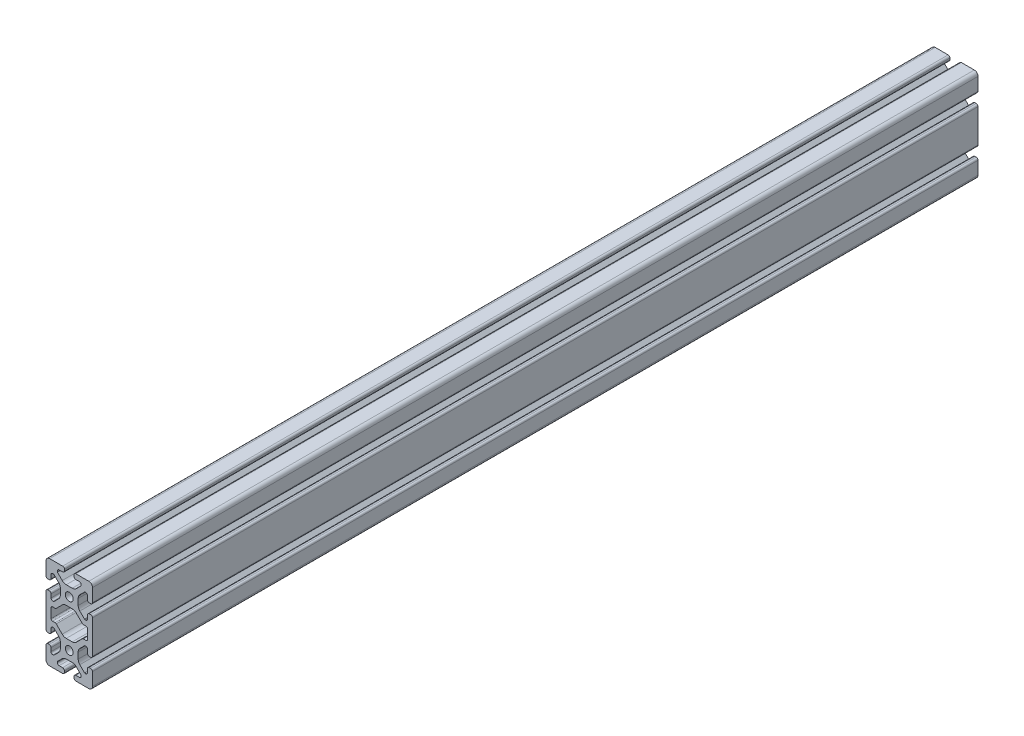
from build123d import *

# Parameters (mm, degrees)
SKETCH1_R           = 3.405
BOSS_EXTRUDE1_DEPTH = 3048
SKETCH26_W          = 40
SKETCH26_H          = 80.80011746
CUT_EXTRUDE1_DEPTH  = 2287.874723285
SKETCH33_W          = 40
SKETCH33_H          = 80.80011746
CUT_EXTRUDE2_DEPTH  = 1526.311771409


with BuildPart() as part:
    # Sketch1 → Boss-Extrude1 (new body)
    with BuildSketch(Plane(origin=(0, 0, -3048), x_dir=(-1, 0, 0), z_dir=(0, 0, -1))):
        with BuildLine():
            Line((16.83, 60), (5.69044933, 60))
            ThreePointArc((5.69044933, 60), (4.580291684, 59.540157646), (4.12044933, 58.43))
            Line((4.12044933, 58.43), (4.12044933, 57.25))
            ThreePointArc((4.12044933, 57.25), (4.580291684, 56.139842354), (5.69044933, 55.68))
            Line((5.69044933, 55.68), (8.7153995, 55.68))
            ThreePointArc((8.7153995, 55.68), (9.825557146, 55.220157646), (10.2853995, 54.11))
            Line((10.2853995, 54.11), (10.2853995, 53.654903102))
            ThreePointArc((10.2853995, 53.654903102), (10.227547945, 53.364063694), (10.062800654, 53.117501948))
            Line((10.062800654, 53.117501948), (6.055092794, 49.109794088))
            ThreePointArc((6.055092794, 49.109794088), (4.47691877, 48.055291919), (2.615335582, 47.685))
            Line((2.615335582, 47.685), (-2.615335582, 47.685))
            ThreePointArc((-2.615335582, 47.685), (-4.47691877, 48.055291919), (-6.055092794, 49.109794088))
            Line((-6.055092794, 49.109794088), (-10.062800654, 53.117501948))
            ThreePointArc((-10.062800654, 53.117501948), (-10.227547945, 53.364063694), (-10.2853995, 53.654903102))
            Line((-10.2853995, 53.654903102), (-10.2853995, 54.11))
            ThreePointArc((-10.2853995, 54.11), (-9.825557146, 55.220157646), (-8.7153995, 55.68))
            Line((-8.7153995, 55.68), (-5.69044933, 55.68))
            ThreePointArc((-5.69044933, 55.68), (-4.580291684, 56.139842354), (-4.12044933, 57.25))
            Line((-4.12044933, 57.25), (-4.12044933, 58.43))
            ThreePointArc((-4.12044933, 58.43), (-4.580291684, 59.540157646), (-5.69044933, 60))
            Line((-5.69044933, 60), (-16.83, 60))
            ThreePointArc((-16.83, 60), (-19.071528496, 59.071528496), (-20, 56.83))
            Line((-20, 56.83), (-20, 45.69044933))
            ThreePointArc((-20, 45.69044933), (-19.540157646, 44.580291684), (-18.43, 44.12044933))
            Line((-18.43, 44.12044933), (-17.25, 44.12044933))
            ThreePointArc((-17.25, 44.12044933), (-16.139842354, 44.580291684), (-15.68, 45.69044933))
            Line((-15.68, 45.69044933), (-15.68, 48.7153995))
            ThreePointArc((-15.68, 48.7153995), (-15.220157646, 49.825557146), (-14.11, 50.2853995))
            Line((-14.11, 50.2853995), (-13.652670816, 50.2853995))
            ThreePointArc((-13.652670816, 50.2853995), (-13.361831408, 50.227547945), (-13.115269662, 50.062800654))
            Line((-13.115269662, 50.062800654), (-9.109794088, 46.05732508))
            ThreePointArc((-9.109794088, 46.05732508), (-8.055291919, 44.479151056), (-7.685, 42.617567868))
            Line((-7.685, 42.617567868), (-7.685, 37.384664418))
            ThreePointArc((-7.685, 37.384664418), (-8.055291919, 35.52308123), (-9.109794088, 33.944907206))
            Line((-9.109794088, 33.944907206), (-13.117501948, 29.937199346))
            ThreePointArc((-13.117501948, 29.937199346), (-13.364063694, 29.772452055), (-13.654903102, 29.7146005))
            Line((-13.654903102, 29.7146005), (-14.11, 29.7146005))
            ThreePointArc((-14.11, 29.7146005), (-15.220157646, 30.174442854), (-15.68, 31.2846005))
            Line((-15.68, 31.2846005), (-15.68, 34.30955067))
            ThreePointArc((-15.68, 34.30955067), (-16.139842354, 35.419708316), (-17.25, 35.87955067))
            Line((-17.25, 35.87955067), (-18.43, 35.87955067))
            ThreePointArc((-18.43, 35.87955067), (-19.540157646, 35.419708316), (-20, 34.30955067))
            Line((-20, 34.30955067), (-20, 5.69044933))
            ThreePointArc((-20, 5.69044933), (-19.540157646, 4.580291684), (-18.43, 4.12044933))
            Line((-18.43, 4.12044933), (-17.25, 4.12044933))
            ThreePointArc((-17.25, 4.12044933), (-16.139842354, 4.580291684), (-15.68, 5.69044933))
            Line((-15.68, 5.69044933), (-15.68, 8.7153995))
            ThreePointArc((-15.68, 8.7153995), (-15.220157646, 9.825557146), (-14.11, 10.2853995))
            Line((-14.11, 10.2853995), (-13.654903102, 10.2853995))
            ThreePointArc((-13.654903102, 10.2853995), (-13.364063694, 10.227547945), (-13.117501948, 10.062800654))
            Line((-13.117501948, 10.062800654), (-9.109794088, 6.055092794))
            ThreePointArc((-9.109794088, 6.055092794), (-8.055291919, 4.47691877), (-7.685, 2.615335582))
            Line((-7.685, 2.615335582), (-7.685, -2.615335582))
            ThreePointArc((-7.685, -2.615335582), (-8.055291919, -4.47691877), (-9.109794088, -6.055092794))
            Line((-9.109794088, -6.055092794), (-13.117501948, -10.062800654))
            ThreePointArc((-13.117501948, -10.062800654), (-13.364063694, -10.227547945), (-13.654903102, -10.2853995))
            Line((-13.654903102, -10.2853995), (-14.11, -10.2853995))
            ThreePointArc((-14.11, -10.2853995), (-15.220157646, -9.825557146), (-15.68, -8.7153995))
            Line((-15.68, -8.7153995), (-15.68, -5.69044933))
            ThreePointArc((-15.68, -5.69044933), (-16.139842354, -4.580291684), (-17.25, -4.12044933))
            Line((-17.25, -4.12044933), (-18.43, -4.12044933))
            ThreePointArc((-18.43, -4.12044933), (-19.540157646, -4.580291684), (-20, -5.69044933))
            Line((-20, -5.69044933), (-20, -16.83))
            ThreePointArc((-20, -16.83), (-19.071528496, -19.071528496), (-16.83, -20))
            Line((-16.83, -20), (-5.69044933, -20))
            ThreePointArc((-5.69044933, -20), (-4.580291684, -19.540157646), (-4.12044933, -18.43))
            Line((-4.12044933, -18.43), (-4.12044933, -17.25))
            ThreePointArc((-4.12044933, -17.25), (-4.580291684, -16.139842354), (-5.69044933, -15.68))
            Line((-5.69044933, -15.68), (-8.7153995, -15.68))
            ThreePointArc((-8.7153995, -15.68), (-9.825557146, -15.220157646), (-10.2853995, -14.11))
            Line((-10.2853995, -14.11), (-10.2853995, -13.654903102))
            ThreePointArc((-10.2853995, -13.654903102), (-10.227547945, -13.364063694), (-10.062800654, -13.117501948))
            Line((-10.062800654, -13.117501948), (-6.055092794, -9.109794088))
            ThreePointArc((-6.055092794, -9.109794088), (-4.47691877, -8.055291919), (-2.615335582, -7.685))
            Line((-2.615335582, -7.685), (2.615335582, -7.685))
            ThreePointArc((2.615335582, -7.685), (4.47691877, -8.055291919), (6.055092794, -9.109794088))
            Line((6.055092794, -9.109794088), (10.062800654, -13.117501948))
            ThreePointArc((10.062800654, -13.117501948), (10.227547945, -13.364063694), (10.2853995, -13.654903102))
            Line((10.2853995, -13.654903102), (10.2853995, -14.11))
            ThreePointArc((10.2853995, -14.11), (9.825557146, -15.220157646), (8.7153995, -15.68))
            Line((8.7153995, -15.68), (5.69044933, -15.68))
            ThreePointArc((5.69044933, -15.68), (4.580291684, -16.139842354), (4.12044933, -17.25))
            Line((4.12044933, -17.25), (4.12044933, -18.43))
            ThreePointArc((4.12044933, -18.43), (4.580291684, -19.540157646), (5.69044933, -20))
            Line((5.69044933, -20), (16.83, -20))
            ThreePointArc((16.83, -20), (19.071528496, -19.071528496), (20, -16.83))
            Line((20, -16.83), (20, -5.69044933))
            ThreePointArc((20, -5.69044933), (19.540157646, -4.580291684), (18.43, -4.12044933))
            Line((18.43, -4.12044933), (17.25, -4.12044933))
            ThreePointArc((17.25, -4.12044933), (16.139842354, -4.580291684), (15.68, -5.69044933))
            Line((15.68, -5.69044933), (15.68, -8.7153995))
            ThreePointArc((15.68, -8.7153995), (15.220157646, -9.825557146), (14.11, -10.2853995))
            Line((14.11, -10.2853995), (13.654903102, -10.2853995))
            ThreePointArc((13.654903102, -10.2853995), (13.364063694, -10.227547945), (13.117501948, -10.062800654))
            Line((13.117501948, -10.062800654), (9.109794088, -6.055092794))
            ThreePointArc((9.109794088, -6.055092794), (8.055291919, -4.47691877), (7.685, -2.615335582))
            Line((7.685, -2.615335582), (7.685, 2.615335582))
            ThreePointArc((7.685, 2.615335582), (8.055291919, 4.47691877), (9.109794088, 6.055092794))
            Line((9.109794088, 6.055092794), (13.117501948, 10.062800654))
            ThreePointArc((13.117501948, 10.062800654), (13.364063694, 10.227547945), (13.654903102, 10.2853995))
            Line((13.654903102, 10.2853995), (14.11, 10.2853995))
            ThreePointArc((14.11, 10.2853995), (15.220157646, 9.825557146), (15.68, 8.7153995))
            Line((15.68, 8.7153995), (15.68, 5.69044933))
            ThreePointArc((15.68, 5.69044933), (16.139842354, 4.580291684), (17.25, 4.12044933))
            Line((17.25, 4.12044933), (18.43, 4.12044933))
            ThreePointArc((18.43, 4.12044933), (19.540157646, 4.580291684), (20, 5.69044933))
            Line((20, 5.69044933), (20, 34.30955067))
            ThreePointArc((20, 34.30955067), (19.540157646, 35.419708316), (18.43, 35.87955067))
            Line((18.43, 35.87955067), (17.25, 35.87955067))
            ThreePointArc((17.25, 35.87955067), (16.139842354, 35.419708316), (15.68, 34.30955067))
            Line((15.68, 34.30955067), (15.68, 31.2846005))
            ThreePointArc((15.68, 31.2846005), (15.220157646, 30.174442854), (14.11, 29.7146005))
            Line((14.11, 29.7146005), (13.654903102, 29.7146005))
            ThreePointArc((13.654903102, 29.7146005), (13.364063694, 29.772452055), (13.117501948, 29.937199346))
            Line((13.117501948, 29.937199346), (9.109794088, 33.944907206))
            ThreePointArc((9.109794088, 33.944907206), (8.055291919, 35.52308123), (7.685, 37.384664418))
            Line((7.685, 37.384664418), (7.685, 42.615335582))
            ThreePointArc((7.685, 42.615335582), (8.055291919, 44.47691877), (9.109794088, 46.055092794))
            Line((9.109794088, 46.055092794), (13.117501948, 50.062800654))
            ThreePointArc((13.117501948, 50.062800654), (13.364063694, 50.227547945), (13.654903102, 50.2853995))
            Line((13.654903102, 50.2853995), (14.11, 50.2853995))
            ThreePointArc((14.11, 50.2853995), (15.220157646, 49.825557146), (15.68, 48.7153995))
            Line((15.68, 48.7153995), (15.68, 45.69044933))
            ThreePointArc((15.68, 45.69044933), (16.139842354, 44.580291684), (17.25, 44.12044933))
            Line((17.25, 44.12044933), (18.43, 44.12044933))
            ThreePointArc((18.43, 44.12044933), (19.540157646, 44.580291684), (20, 45.69044933))
            Line((20, 45.69044933), (20, 56.83))
            ThreePointArc((20, 56.83), (19.071528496, 59.071528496), (16.83, 60))
        make_face()
        with Locations(Location((0, 0, 0), (0, 0, 180))):
            Circle(SKETCH1_R, mode=Mode.SUBTRACT)
        with Locations(Location((0, 40, 0), (0, 0, 180))):
            Circle(SKETCH1_R, mode=Mode.SUBTRACT)
        with BuildLine():
            Line((14.41, 14.65864833), (12.129998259, 14.65864833))
            ThreePointArc((12.129998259, 14.65864833), (11.608780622, 14.546764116), (11.179399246, 14.230824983))
            Line((11.179399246, 14.230824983), (6.055092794, 9.109794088))
            ThreePointArc((6.055092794, 9.109794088), (4.47691877, 8.055291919), (2.615335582, 7.685))
            Line((2.615335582, 7.685), (-2.615335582, 7.685))
            ThreePointArc((-2.615335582, 7.685), (-4.47691877, 8.055291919), (-6.055092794, 9.109794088))
            Line((-6.055092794, 9.109794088), (-11.231972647, 14.286673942))
            ThreePointArc((-11.231972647, 14.286673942), (-11.6439903, 14.561975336), (-12.129998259, 14.65864833))
            Line((-12.129998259, 14.65864833), (-14.41, 14.65864833))
            ThreePointArc((-14.41, 14.65864833), (-15.308025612, 15.030622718), (-15.68, 15.92864833))
            Line((-15.68, 15.92864833), (-15.68, 24.07135167))
            ThreePointArc((-15.68, 24.07135167), (-15.308025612, 24.969377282), (-14.41, 25.34135167))
            Line((-14.41, 25.34135167), (-12.129998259, 25.34135167))
            ThreePointArc((-12.129998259, 25.34135167), (-11.6439903, 25.438024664), (-11.231972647, 25.713326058))
            Line((-11.231972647, 25.713326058), (-6.055092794, 30.890205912))
            ThreePointArc((-6.055092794, 30.890205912), (-4.47691877, 31.944708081), (-2.615335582, 32.315))
            Line((-2.615335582, 32.315), (2.617567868, 32.315))
            ThreePointArc((2.617567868, 32.315), (4.479151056, 31.944708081), (6.05732508, 30.890205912))
            Line((6.05732508, 30.890205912), (11.184160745, 25.763370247))
            ThreePointArc((11.184160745, 25.763370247), (11.612140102, 25.451641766), (12.129998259, 25.34135167))
            Line((12.129998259, 25.34135167), (14.41, 25.34135167))
            ThreePointArc((14.41, 25.34135167), (15.308025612, 24.969377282), (15.68, 24.07135167))
            Line((15.68, 24.07135167), (15.68, 15.92864833))
            ThreePointArc((15.68, 15.92864833), (15.308025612, 15.030622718), (14.41, 14.65864833))
        make_face(mode=Mode.SUBTRACT)
    extrude(amount=-BOSS_EXTRUDE1_DEPTH)

    # Sketch26 → Cut-Extrude1 (cut, through all)
    with BuildSketch(Plane.XY.offset(-762)):
        with Locations((0, 19.59994127)):
            Rectangle(SKETCH26_W, SKETCH26_H)
    extrude(amount=CUT_EXTRUDE1_DEPTH, mode=Mode.SUBTRACT)

    # Sketch33 → Cut-Extrude2 (cut, through all)
    with BuildSketch(Plane.XY.offset(-1524)):
        with Locations((0, 19.59994127)):
            Rectangle(SKETCH33_W, SKETCH33_H)
    extrude(amount=-CUT_EXTRUDE2_DEPTH, mode=Mode.SUBTRACT)


solid = part.part
